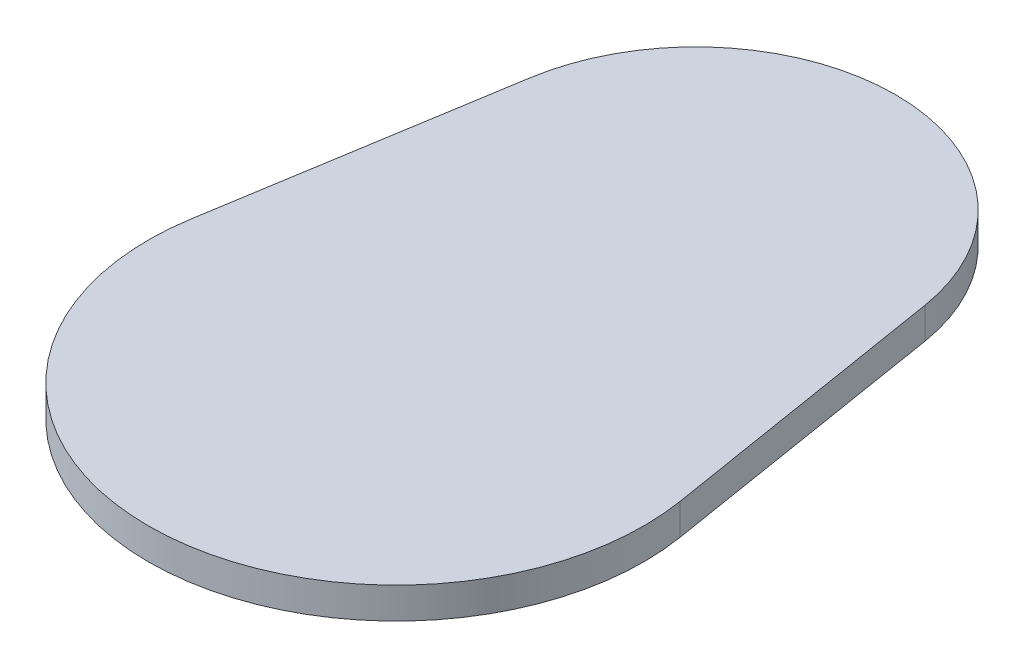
from build123d import *

# Parameters (mm, degrees)
EXTRUDE1_DEPTH = 1.9812


with BuildPart() as part:
    # Sketch1 → Extrude1 (new body)
    with BuildSketch(Plane(origin=(0, 0, 0), x_dir=(1, 0, 0), z_dir=(0, 1, 0))):
        with BuildLine():
            Line((12.536386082, 2.032), (15.545118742, -16.53032))
            ThreePointArc((15.545118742, -16.53032), (0, -34.798), (-15.545118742, -16.53032))
            Line((-15.545118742, -16.53032), (-12.536386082, 2.032))
            ThreePointArc((-12.536386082, 2.032), (0, 12.7), (12.536386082, 2.032))
        make_face()
    extrude(amount=EXTRUDE1_DEPTH)


solid = part.part
